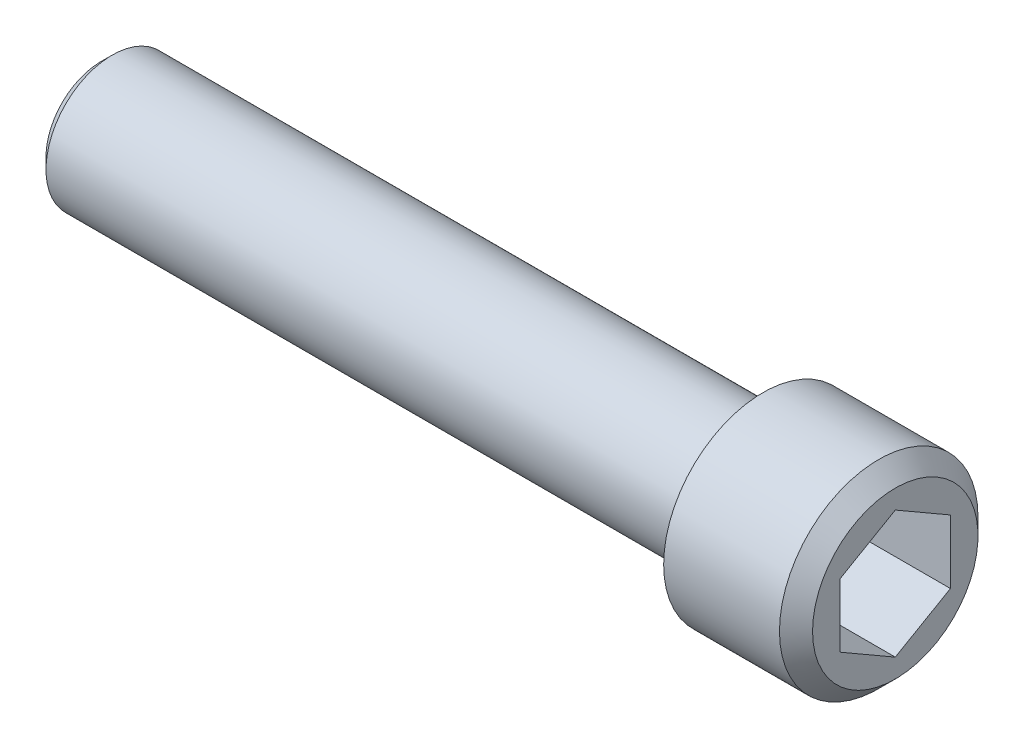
ISO-10303-21;
HEADER;
FILE_DESCRIPTION(('STEP AP214'),'2;1');
FILE_NAME('part.step','',(''),(''),'','','');
FILE_SCHEMA(('AUTOMOTIVE_DESIGN { 1 0 10303 214 1 1 1 1 }'));
ENDSEC;
DATA;
#1=APPLICATION_CONTEXT('core data for automotive mechanical design processes');
#2=APPLICATION_PROTOCOL_DEFINITION('international standard','automotive_design',2000,#1);
#3=PRODUCT_CONTEXT('',#1,'mechanical');
#4=PRODUCT('Part','Part','',(#3));
#5=PRODUCT_RELATED_PRODUCT_CATEGORY('part','',(#4));
#6=PRODUCT_DEFINITION_FORMATION('','',#4);
#7=PRODUCT_DEFINITION_CONTEXT('part definition',#1,'design');
#8=PRODUCT_DEFINITION('design','',#6,#7);
#9=PRODUCT_DEFINITION_SHAPE('','',#8);
#10=(LENGTH_UNIT() NAMED_UNIT(*) SI_UNIT(.MILLI.,.METRE.));
#11=(NAMED_UNIT(*) PLANE_ANGLE_UNIT() SI_UNIT($,.RADIAN.));
#12=(NAMED_UNIT(*) SI_UNIT($,.STERADIAN.) SOLID_ANGLE_UNIT());
#13=UNCERTAINTY_MEASURE_WITH_UNIT(LENGTH_MEASURE(1.E-05),#10,'distance_accuracy_value','');
#14=(GEOMETRIC_REPRESENTATION_CONTEXT(3) GLOBAL_UNCERTAINTY_ASSIGNED_CONTEXT((#13)) GLOBAL_UNIT_ASSIGNED_CONTEXT((#10,
#11,#12)) REPRESENTATION_CONTEXT('',''));
#15=CARTESIAN_POINT('',(0.,0.,0.));
#16=DIRECTION('',(0.,0.,1.));
#17=DIRECTION('',(1.,0.,0.));
#18=AXIS2_PLACEMENT_3D('',#15,#16,#17);
#19=CARTESIAN_POINT('',(32.,0.,0.));
#20=DIRECTION('',(1.,0.,0.));
#21=DIRECTION('',(0.,0.,-1.));
#22=AXIS2_PLACEMENT_3D('',#19,#20,#21);
#23=PLANE('',#22);
#24=DIRECTION('',(0.,-0.5,0.866025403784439));
#25=VECTOR('',#24,1.);
#26=CARTESIAN_POINT('',(32.,2.88675134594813,0.));
#27=LINE('',#26,#25);
#28=CARTESIAN_POINT('',(32.,2.88675134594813,0.));
#29=VERTEX_POINT('',#28);
#30=CARTESIAN_POINT('',(32.,1.44337567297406,2.5));
#31=VERTEX_POINT('',#30);
#32=EDGE_CURVE('E83',#29,#31,#27,.T.);
#33=ORIENTED_EDGE('',*,*,#32,.T.);
#34=DIRECTION('',(0.,1.,0.));
#35=VECTOR('',#34,1.);
#36=CARTESIAN_POINT('',(32.,1.44337567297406,2.5));
#37=LINE('',#36,#35);
#38=CARTESIAN_POINT('',(32.,-1.44337567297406,2.5));
#39=VERTEX_POINT('',#38);
#40=EDGE_CURVE('E67',#31,#39,#37,.F.);
#41=ORIENTED_EDGE('',*,*,#40,.T.);
#42=DIRECTION('',(0.,-0.5,-0.866025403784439));
#43=VECTOR('',#42,1.);
#44=CARTESIAN_POINT('',(32.,-1.44337567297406,2.5));
#45=LINE('',#44,#43);
#46=CARTESIAN_POINT('',(32.,-2.88675134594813,0.));
#47=VERTEX_POINT('',#46);
#48=EDGE_CURVE('E72',#39,#47,#45,.T.);
#49=ORIENTED_EDGE('',*,*,#48,.T.);
#50=DIRECTION('',(0.,0.5,-0.866025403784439));
#51=VECTOR('',#50,1.);
#52=CARTESIAN_POINT('',(32.,-2.88675134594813,0.));
#53=LINE('',#52,#51);
#54=CARTESIAN_POINT('',(32.,-1.44337567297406,-2.5));
#55=VERTEX_POINT('',#54);
#56=EDGE_CURVE('E128',#47,#55,#53,.T.);
#57=ORIENTED_EDGE('',*,*,#56,.T.);
#58=DIRECTION('',(0.,1.,0.));
#59=VECTOR('',#58,1.);
#60=CARTESIAN_POINT('',(32.,-1.44337567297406,-2.5));
#61=LINE('',#60,#59);
#62=CARTESIAN_POINT('',(32.,1.44337567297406,-2.5));
#63=VERTEX_POINT('',#62);
#64=EDGE_CURVE('E132',#55,#63,#61,.T.);
#65=ORIENTED_EDGE('',*,*,#64,.T.);
#66=DIRECTION('',(0.,0.5,0.866025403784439));
#67=VECTOR('',#66,1.);
#68=CARTESIAN_POINT('',(32.,1.44337567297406,-2.5));
#69=LINE('',#68,#67);
#70=EDGE_CURVE('E137',#63,#29,#69,.T.);
#71=ORIENTED_EDGE('',*,*,#70,.T.);
#72=EDGE_LOOP('',(#33,#41,#49,#57,#65,#71));
#73=FACE_BOUND('',#72,.T.);
#74=ADVANCED_FACE('F17',(#73),#23,.T.);
#75=CARTESIAN_POINT('',(36.,-1.44337567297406,2.5));
#76=DIRECTION('',(0.,-0.866025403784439,0.5));
#77=DIRECTION('',(0.,-0.5,-0.866025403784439));
#78=AXIS2_PLACEMENT_3D('',#75,#76,#77);
#79=PLANE('',#78);
#80=DIRECTION('',(1.,0.,0.));
#81=VECTOR('',#80,1.);
#82=CARTESIAN_POINT('',(36.,-1.44337567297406,2.5));
#83=LINE('',#82,#81);
#84=CARTESIAN_POINT('',(36.,-1.44337567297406,2.5));
#85=VERTEX_POINT('',#84);
#86=EDGE_CURVE('E74',#39,#85,#83,.T.);
#87=ORIENTED_EDGE('',*,*,#86,.T.);
#88=DIRECTION('',(0.,0.5,0.866025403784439));
#89=VECTOR('',#88,1.);
#90=CARTESIAN_POINT('',(36.,-2.88675134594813,0.));
#91=LINE('',#90,#89);
#92=CARTESIAN_POINT('',(36.,-2.88675134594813,0.));
#93=VERTEX_POINT('',#92);
#94=EDGE_CURVE('E126',#93,#85,#91,.T.);
#95=ORIENTED_EDGE('',*,*,#94,.F.);
#96=DIRECTION('',(1.,0.,0.));
#97=VECTOR('',#96,1.);
#98=CARTESIAN_POINT('',(36.,-2.88675134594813,0.));
#99=LINE('',#98,#97);
#100=EDGE_CURVE('E77',#93,#47,#99,.F.);
#101=ORIENTED_EDGE('',*,*,#100,.T.);
#102=ORIENTED_EDGE('',*,*,#48,.F.);
#103=EDGE_LOOP('',(#87,#95,#101,#102));
#104=FACE_BOUND('',#103,.T.);
#105=ADVANCED_FACE('F73',(#104),#79,.F.);
#106=CARTESIAN_POINT('',(36.,1.44337567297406,2.5));
#107=DIRECTION('',(0.,0.,1.));
#108=DIRECTION('',(1.,0.,0.));
#109=AXIS2_PLACEMENT_3D('',#106,#107,#108);
#110=PLANE('',#109);
#111=DIRECTION('',(1.,0.,0.));
#112=VECTOR('',#111,1.);
#113=CARTESIAN_POINT('',(36.,1.44337567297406,2.5));
#114=LINE('',#113,#112);
#115=CARTESIAN_POINT('',(36.,1.44337567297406,2.5));
#116=VERTEX_POINT('',#115);
#117=EDGE_CURVE('E85',#31,#116,#114,.T.);
#118=ORIENTED_EDGE('',*,*,#117,.T.);
#119=DIRECTION('',(0.,1.,0.));
#120=VECTOR('',#119,1.);
#121=CARTESIAN_POINT('',(36.,1.875,2.5));
#122=LINE('',#121,#120);
#123=EDGE_CURVE('E89',#85,#116,#122,.T.);
#124=ORIENTED_EDGE('',*,*,#123,.F.);
#125=ORIENTED_EDGE('',*,*,#86,.F.);
#126=ORIENTED_EDGE('',*,*,#40,.F.);
#127=EDGE_LOOP('',(#118,#124,#125,#126));
#128=FACE_BOUND('',#127,.T.);
#129=ADVANCED_FACE('F87',(#128),#110,.F.);
#130=CARTESIAN_POINT('',(36.,2.88675134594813,0.));
#131=DIRECTION('',(0.,0.866025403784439,0.5));
#132=DIRECTION('',(0.,-0.5,0.866025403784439));
#133=AXIS2_PLACEMENT_3D('',#130,#131,#132);
#134=PLANE('',#133);
#135=DIRECTION('',(1.,0.,0.));
#136=VECTOR('',#135,1.);
#137=CARTESIAN_POINT('',(36.,2.88675134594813,0.));
#138=LINE('',#137,#136);
#139=CARTESIAN_POINT('',(36.,2.88675134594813,0.));
#140=VERTEX_POINT('',#139);
#141=EDGE_CURVE('E139',#29,#140,#138,.T.);
#142=ORIENTED_EDGE('',*,*,#141,.T.);
#143=DIRECTION('',(0.,0.5,-0.866025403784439));
#144=VECTOR('',#143,1.);
#145=CARTESIAN_POINT('',(36.,1.44337567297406,2.5));
#146=LINE('',#145,#144);
#147=EDGE_CURVE('E122',#116,#140,#146,.T.);
#148=ORIENTED_EDGE('',*,*,#147,.F.);
#149=ORIENTED_EDGE('',*,*,#117,.F.);
#150=ORIENTED_EDGE('',*,*,#32,.F.);
#151=EDGE_LOOP('',(#142,#148,#149,#150));
#152=FACE_BOUND('',#151,.T.);
#153=ADVANCED_FACE('F143',(#152),#134,.F.);
#154=CARTESIAN_POINT('',(36.,1.44337567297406,-2.5));
#155=DIRECTION('',(0.,0.866025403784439,-0.5));
#156=DIRECTION('',(0.,0.5,0.866025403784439));
#157=AXIS2_PLACEMENT_3D('',#154,#155,#156);
#158=PLANE('',#157);
#159=DIRECTION('',(-1.,0.,0.));
#160=VECTOR('',#159,1.);
#161=CARTESIAN_POINT('',(36.,1.44337567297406,-2.5));
#162=LINE('',#161,#160);
#163=CARTESIAN_POINT('',(36.,1.44337567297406,-2.5));
#164=VERTEX_POINT('',#163);
#165=EDGE_CURVE('E135',#63,#164,#162,.F.);
#166=ORIENTED_EDGE('',*,*,#165,.T.);
#167=DIRECTION('',(0.,-0.5,-0.866025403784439));
#168=VECTOR('',#167,1.);
#169=CARTESIAN_POINT('',(36.,2.88675134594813,0.));
#170=LINE('',#169,#168);
#171=EDGE_CURVE('E119',#140,#164,#170,.T.);
#172=ORIENTED_EDGE('',*,*,#171,.F.);
#173=ORIENTED_EDGE('',*,*,#141,.F.);
#174=ORIENTED_EDGE('',*,*,#70,.F.);
#175=EDGE_LOOP('',(#166,#172,#173,#174));
#176=FACE_BOUND('',#175,.T.);
#177=ADVANCED_FACE('F154',(#176),#158,.F.);
#178=CARTESIAN_POINT('',(36.,-1.44337567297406,-2.5));
#179=DIRECTION('',(0.,0.,-1.));
#180=DIRECTION('',(-1.,0.,0.));
#181=AXIS2_PLACEMENT_3D('',#178,#179,#180);
#182=PLANE('',#181);
#183=DIRECTION('',(1.,0.,0.));
#184=VECTOR('',#183,1.);
#185=CARTESIAN_POINT('',(36.,-1.44337567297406,-2.5));
#186=LINE('',#185,#184);
#187=CARTESIAN_POINT('',(36.,-1.44337567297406,-2.5));
#188=VERTEX_POINT('',#187);
#189=EDGE_CURVE('E35',#55,#188,#186,.T.);
#190=ORIENTED_EDGE('',*,*,#189,.T.);
#191=DIRECTION('',(0.,1.,0.));
#192=VECTOR('',#191,1.);
#193=CARTESIAN_POINT('',(36.,1.875,-2.5));
#194=LINE('',#193,#192);
#195=EDGE_CURVE('E116',#164,#188,#194,.F.);
#196=ORIENTED_EDGE('',*,*,#195,.F.);
#197=ORIENTED_EDGE('',*,*,#165,.F.);
#198=ORIENTED_EDGE('',*,*,#64,.F.);
#199=EDGE_LOOP('',(#190,#196,#197,#198));
#200=FACE_BOUND('',#199,.T.);
#201=ADVANCED_FACE('F152',(#200),#182,.F.);
#202=CARTESIAN_POINT('',(36.,-2.88675134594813,0.));
#203=DIRECTION('',(0.,-0.866025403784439,-0.5));
#204=DIRECTION('',(0.,0.5,-0.866025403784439));
#205=AXIS2_PLACEMENT_3D('',#202,#203,#204);
#206=PLANE('',#205);
#207=ORIENTED_EDGE('',*,*,#100,.F.);
#208=DIRECTION('',(0.,-0.5,0.866025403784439));
#209=VECTOR('',#208,1.);
#210=CARTESIAN_POINT('',(36.,-1.44337567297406,-2.5));
#211=LINE('',#210,#209);
#212=EDGE_CURVE('E108',#188,#93,#211,.T.);
#213=ORIENTED_EDGE('',*,*,#212,.F.);
#214=ORIENTED_EDGE('',*,*,#189,.F.);
#215=ORIENTED_EDGE('',*,*,#56,.F.);
#216=EDGE_LOOP('',(#207,#213,#214,#215));
#217=FACE_BOUND('',#216,.T.);
#218=ADVANCED_FACE('F150',(#217),#206,.F.);
#219=CARTESIAN_POINT('',(36.,1.875,0.));
#220=DIRECTION('',(1.,0.,0.));
#221=DIRECTION('',(0.,0.,-1.));
#222=AXIS2_PLACEMENT_3D('',#219,#220,#221);
#223=PLANE('',#222);
#224=ORIENTED_EDGE('',*,*,#195,.T.);
#225=ORIENTED_EDGE('',*,*,#212,.T.);
#226=ORIENTED_EDGE('',*,*,#94,.T.);
#227=ORIENTED_EDGE('',*,*,#123,.T.);
#228=ORIENTED_EDGE('',*,*,#147,.T.);
#229=ORIENTED_EDGE('',*,*,#171,.T.);
#230=EDGE_LOOP('',(#224,#225,#226,#227,#228,#229));
#231=FACE_BOUND('',#230,.T.);
#232=CARTESIAN_POINT('',(36.0000000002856,0.,0.));
#233=DIRECTION('',(-1.,0.,0.));
#234=DIRECTION('',(0.,0.,1.));
#235=AXIS2_PLACEMENT_3D('',#232,#233,#234);
#236=CIRCLE('',#235,3.75000000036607);
#237=CARTESIAN_POINT('',(36.0000000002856,0.,3.75000000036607));
#238=VERTEX_POINT('',#237);
#239=EDGE_CURVE('E20',#238,#238,#236,.T.);
#240=ORIENTED_EDGE('',*,*,#239,.F.);
#241=EDGE_LOOP('',(#240));
#242=FACE_BOUND('',#241,.T.);
#243=ADVANCED_FACE('F147',(#231,#242),#223,.T.);
#244=CARTESIAN_POINT('',(35.2499999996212,0.,0.));
#245=DIRECTION('',(-1.,0.,0.));
#246=DIRECTION('',(0.,0.,1.));
#247=AXIS2_PLACEMENT_3D('',#244,#245,#246);
#248=CONICAL_SURFACE('',#247,4.49999999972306,0.785398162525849);
#249=CARTESIAN_POINT('',(35.25,0.,0.));
#250=DIRECTION('',(1.,0.,0.));
#251=DIRECTION('',(0.,0.,-1.));
#252=AXIS2_PLACEMENT_3D('',#249,#250,#251);
#253=CIRCLE('',#252,4.5);
#254=CARTESIAN_POINT('',(35.25,0.,-4.5));
#255=VERTEX_POINT('',#254);
#256=EDGE_CURVE('E100',#255,#255,#253,.F.);
#257=ORIENTED_EDGE('',*,*,#256,.F.);
#258=EDGE_LOOP('',(#257));
#259=FACE_BOUND('',#258,.T.);
#260=ORIENTED_EDGE('',*,*,#239,.T.);
#261=EDGE_LOOP('',(#260));
#262=FACE_BOUND('',#261,.T.);
#263=ADVANCED_FACE('F187',(#259,#262),#248,.T.);
#264=CARTESIAN_POINT('',(32.625,0.,0.));
#265=DIRECTION('',(1.,0.,0.));
#266=DIRECTION('',(0.,0.,-1.));
#267=AXIS2_PLACEMENT_3D('',#264,#265,#266);
#268=CYLINDRICAL_SURFACE('',#267,4.5);
#269=CARTESIAN_POINT('',(30.,0.,0.));
#270=DIRECTION('',(1.,0.,0.));
#271=DIRECTION('',(0.,0.,-1.));
#272=AXIS2_PLACEMENT_3D('',#269,#270,#271);
#273=CIRCLE('',#272,4.5);
#274=CARTESIAN_POINT('',(30.,0.,-4.5));
#275=VERTEX_POINT('',#274);
#276=EDGE_CURVE('E98',#275,#275,#273,.F.);
#277=ORIENTED_EDGE('',*,*,#276,.F.);
#278=EDGE_LOOP('',(#277));
#279=FACE_BOUND('',#278,.T.);
#280=ORIENTED_EDGE('',*,*,#256,.T.);
#281=EDGE_LOOP('',(#280));
#282=FACE_BOUND('',#281,.T.);
#283=ADVANCED_FACE('F183',(#279,#282),#268,.T.);
#284=CARTESIAN_POINT('',(0.,1.25,0.));
#285=DIRECTION('',(-1.,0.,0.));
#286=DIRECTION('',(0.,0.,1.));
#287=AXIS2_PLACEMENT_3D('',#284,#285,#286);
#288=PLANE('',#287);
#289=CARTESIAN_POINT('',(-2.27373675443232E-10,0.,0.));
#290=DIRECTION('',(1.,0.,0.));
#291=DIRECTION('',(0.,0.,-1.));
#292=AXIS2_PLACEMENT_3D('',#289,#290,#291);
#293=CIRCLE('',#292,2.5000000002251);
#294=CARTESIAN_POINT('',(-2.27373675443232E-10,0.,-2.5000000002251));
#295=VERTEX_POINT('',#294);
#296=EDGE_CURVE('E96',#295,#295,#293,.T.);
#297=ORIENTED_EDGE('',*,*,#296,.F.);
#298=EDGE_LOOP('',(#297));
#299=FACE_BOUND('',#298,.T.);
#300=ADVANCED_FACE('F179',(#299),#288,.T.);
#301=CARTESIAN_POINT('',(30.,3.75,0.));
#302=DIRECTION('',(-1.,0.,0.));
#303=DIRECTION('',(0.,0.,1.));
#304=AXIS2_PLACEMENT_3D('',#301,#302,#303);
#305=PLANE('',#304);
#306=CARTESIAN_POINT('',(30.,0.,0.));
#307=DIRECTION('',(1.,0.,0.));
#308=DIRECTION('',(0.,0.,-1.));
#309=AXIS2_PLACEMENT_3D('',#306,#307,#308);
#310=CIRCLE('',#309,3.);
#311=CARTESIAN_POINT('',(30.,0.,-3.));
#312=VERTEX_POINT('',#311);
#313=EDGE_CURVE('E26',#312,#312,#310,.F.);
#314=ORIENTED_EDGE('',*,*,#313,.F.);
#315=EDGE_LOOP('',(#314));
#316=FACE_BOUND('',#315,.T.);
#317=ORIENTED_EDGE('',*,*,#276,.T.);
#318=EDGE_LOOP('',(#317));
#319=FACE_BOUND('',#318,.T.);
#320=ADVANCED_FACE('F172',(#316,#319),#305,.T.);
#321=CARTESIAN_POINT('',(0.50000000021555,0.,0.));
#322=DIRECTION('',(1.,0.,0.));
#323=DIRECTION('',(0.,0.,-1.));
#324=AXIS2_PLACEMENT_3D('',#321,#322,#323);
#325=CONICAL_SURFACE('',#324,2.99999999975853,0.785398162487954);
#326=ORIENTED_EDGE('',*,*,#296,.T.);
#327=EDGE_LOOP('',(#326));
#328=FACE_BOUND('',#327,.T.);
#329=CARTESIAN_POINT('',(0.5,0.,0.));
#330=DIRECTION('',(1.,0.,0.));
#331=DIRECTION('',(0.,0.,-1.));
#332=AXIS2_PLACEMENT_3D('',#329,#330,#331);
#333=CIRCLE('',#332,3.);
#334=CARTESIAN_POINT('',(0.5,0.,-3.));
#335=VERTEX_POINT('',#334);
#336=EDGE_CURVE('E11',#335,#335,#333,.T.);
#337=ORIENTED_EDGE('',*,*,#336,.F.);
#338=EDGE_LOOP('',(#337));
#339=FACE_BOUND('',#338,.T.);
#340=ADVANCED_FACE('F166',(#328,#339),#325,.T.);
#341=CARTESIAN_POINT('',(15.25,0.,0.));
#342=DIRECTION('',(1.,0.,0.));
#343=DIRECTION('',(0.,0.,-1.));
#344=AXIS2_PLACEMENT_3D('',#341,#342,#343);
#345=CYLINDRICAL_SURFACE('',#344,3.);
#346=ORIENTED_EDGE('',*,*,#336,.T.);
#347=EDGE_LOOP('',(#346));
#348=FACE_BOUND('',#347,.T.);
#349=ORIENTED_EDGE('',*,*,#313,.T.);
#350=EDGE_LOOP('',(#349));
#351=FACE_BOUND('',#350,.T.);
#352=ADVANCED_FACE('F164',(#348,#351),#345,.T.);
#353=CLOSED_SHELL('',(#74,#105,#129,#153,#177,#201,#218,#243,#263,#283,#300,#320,#340,#352));
#354=MANIFOLD_SOLID_BREP('B1',#353);
#355=ADVANCED_BREP_SHAPE_REPRESENTATION('',(#18,#354),#14);
#356=SHAPE_DEFINITION_REPRESENTATION(#9,#355);
ENDSEC;
END-ISO-10303-21;
